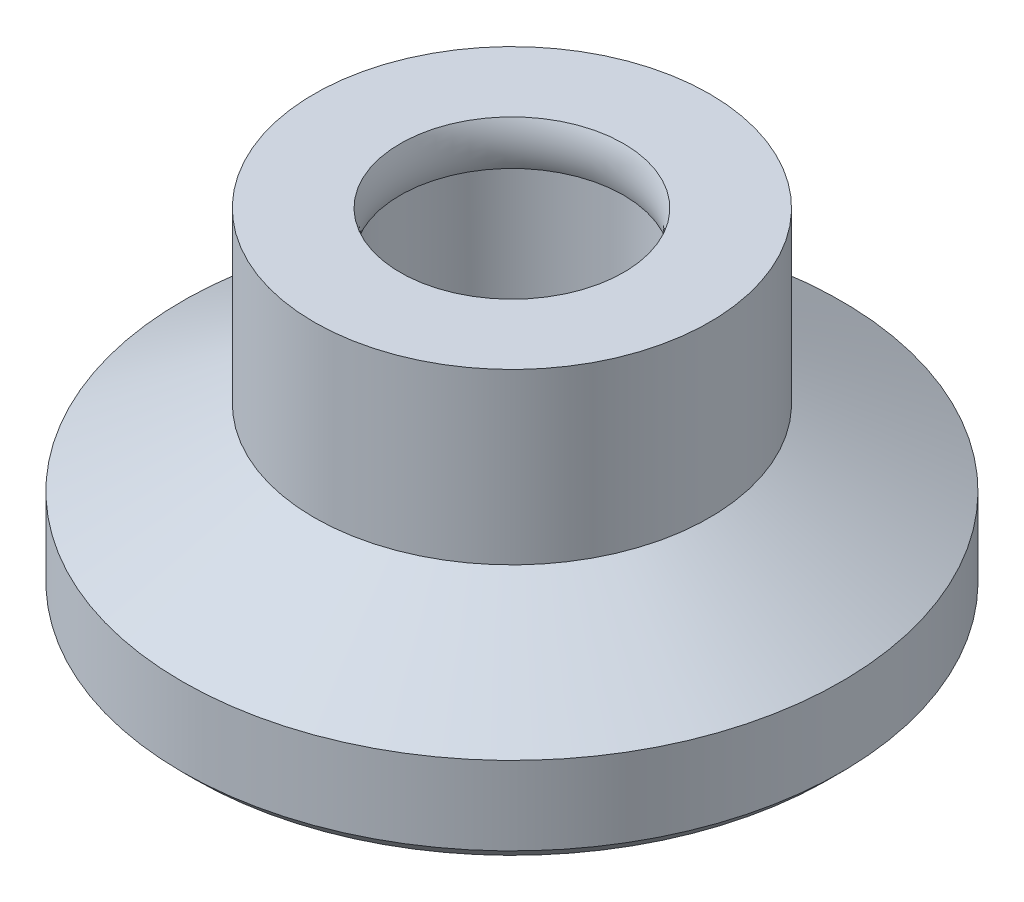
ISO-10303-21;
HEADER;
FILE_DESCRIPTION(('STEP AP214'),'2;1');
FILE_NAME('part.step','',(''),(''),'','','');
FILE_SCHEMA(('AUTOMOTIVE_DESIGN { 1 0 10303 214 1 1 1 1 }'));
ENDSEC;
DATA;
#1=APPLICATION_CONTEXT('core data for automotive mechanical design processes');
#2=APPLICATION_PROTOCOL_DEFINITION('international standard','automotive_design',2000,#1);
#3=PRODUCT_CONTEXT('',#1,'mechanical');
#4=PRODUCT('Part','Part','',(#3));
#5=PRODUCT_RELATED_PRODUCT_CATEGORY('part','',(#4));
#6=PRODUCT_DEFINITION_FORMATION('','',#4);
#7=PRODUCT_DEFINITION_CONTEXT('part definition',#1,'design');
#8=PRODUCT_DEFINITION('design','',#6,#7);
#9=PRODUCT_DEFINITION_SHAPE('','',#8);
#10=(LENGTH_UNIT() NAMED_UNIT(*) SI_UNIT(.MILLI.,.METRE.));
#11=(NAMED_UNIT(*) PLANE_ANGLE_UNIT() SI_UNIT($,.RADIAN.));
#12=(NAMED_UNIT(*) SI_UNIT($,.STERADIAN.) SOLID_ANGLE_UNIT());
#13=UNCERTAINTY_MEASURE_WITH_UNIT(LENGTH_MEASURE(1.E-05),#10,'distance_accuracy_value','');
#14=(GEOMETRIC_REPRESENTATION_CONTEXT(3) GLOBAL_UNCERTAINTY_ASSIGNED_CONTEXT((#13)) GLOBAL_UNIT_ASSIGNED_CONTEXT((#10,
#11,#12)) REPRESENTATION_CONTEXT('',''));
#15=CARTESIAN_POINT('',(0.,0.,0.));
#16=DIRECTION('',(0.,0.,1.));
#17=DIRECTION('',(1.,0.,0.));
#18=AXIS2_PLACEMENT_3D('',#15,#16,#17);
#19=CARTESIAN_POINT('',(0.,4.6,0.));
#20=DIRECTION('',(0.,-1.,0.));
#21=DIRECTION('',(0.,0.,-1.));
#22=AXIS2_PLACEMENT_3D('',#19,#20,#21);
#23=CYLINDRICAL_SURFACE('',#22,5.4);
#24=CARTESIAN_POINT('',(0.,-0.0215390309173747,0.));
#25=DIRECTION('',(0.,1.,0.));
#26=DIRECTION('',(0.,0.,1.));
#27=AXIS2_PLACEMENT_3D('',#24,#25,#26);
#28=CIRCLE('',#27,5.4);
#29=CARTESIAN_POINT('',(0.,-0.0215390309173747,5.4));
#30=VERTEX_POINT('',#29);
#31=EDGE_CURVE('E91',#30,#30,#28,.T.);
#32=ORIENTED_EDGE('',*,*,#31,.T.);
#33=EDGE_LOOP('',(#32));
#34=FACE_BOUND('',#33,.T.);
#35=CARTESIAN_POINT('',(0.,4.6,0.));
#36=DIRECTION('',(0.,1.,0.));
#37=DIRECTION('',(0.,0.,1.));
#38=AXIS2_PLACEMENT_3D('',#35,#36,#37);
#39=CIRCLE('',#38,5.4);
#40=CARTESIAN_POINT('',(0.,4.6,5.4));
#41=VERTEX_POINT('',#40);
#42=EDGE_CURVE('E93',#41,#41,#39,.T.);
#43=ORIENTED_EDGE('',*,*,#42,.F.);
#44=EDGE_LOOP('',(#43));
#45=FACE_BOUND('',#44,.T.);
#46=ADVANCED_FACE('F37',(#34,#45),#23,.T.);
#47=CARTESIAN_POINT('',(0.,4.6,0.));
#48=DIRECTION('',(0.,1.,0.));
#49=DIRECTION('',(0.,0.,1.));
#50=AXIS2_PLACEMENT_3D('',#47,#48,#49);
#51=PLANE('',#50);
#52=CARTESIAN_POINT('',(0.,4.6,0.));
#53=DIRECTION('',(0.,-1.,0.));
#54=DIRECTION('',(0.,0.,-1.));
#55=AXIS2_PLACEMENT_3D('',#52,#53,#54);
#56=CIRCLE('',#55,3.05);
#57=CARTESIAN_POINT('',(0.,4.6,-3.05));
#58=VERTEX_POINT('',#57);
#59=EDGE_CURVE('E113',#58,#58,#56,.T.);
#60=ORIENTED_EDGE('',*,*,#59,.T.);
#61=EDGE_LOOP('',(#60));
#62=FACE_BOUND('',#61,.T.);
#63=ORIENTED_EDGE('',*,*,#42,.T.);
#64=EDGE_LOOP('',(#63));
#65=FACE_BOUND('',#64,.T.);
#66=ADVANCED_FACE('F65',(#62,#65),#51,.T.);
#67=CARTESIAN_POINT('',(0.,-0.0215390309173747,0.));
#68=DIRECTION('',(0.,-1.,0.));
#69=DIRECTION('',(0.,0.,-1.));
#70=AXIS2_PLACEMENT_3D('',#67,#68,#69);
#71=CONICAL_SURFACE('',#70,5.4,1.0471975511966);
#72=CARTESIAN_POINT('',(0.,-2.1,0.));
#73=DIRECTION('',(0.,1.,0.));
#74=DIRECTION('',(0.,0.,1.));
#75=AXIS2_PLACEMENT_3D('',#72,#73,#74);
#76=CIRCLE('',#75,9.);
#77=CARTESIAN_POINT('',(0.,-2.1,9.));
#78=VERTEX_POINT('',#77);
#79=EDGE_CURVE('E89',#78,#78,#76,.T.);
#80=ORIENTED_EDGE('',*,*,#79,.T.);
#81=EDGE_LOOP('',(#80));
#82=FACE_BOUND('',#81,.T.);
#83=ORIENTED_EDGE('',*,*,#31,.F.);
#84=EDGE_LOOP('',(#83));
#85=FACE_BOUND('',#84,.T.);
#86=ADVANCED_FACE('F70',(#82,#85),#71,.T.);
#87=CARTESIAN_POINT('',(0.,-4.6,0.));
#88=DIRECTION('',(0.,1.,0.));
#89=DIRECTION('',(0.,0.,1.));
#90=AXIS2_PLACEMENT_3D('',#87,#88,#89);
#91=PLANE('',#90);
#92=CARTESIAN_POINT('',(0.,-4.6,0.));
#93=DIRECTION('',(0.,1.,0.));
#94=DIRECTION('',(0.,0.,1.));
#95=AXIS2_PLACEMENT_3D('',#92,#93,#94);
#96=CIRCLE('',#95,8.64);
#97=CARTESIAN_POINT('',(0.,-4.6,8.64));
#98=VERTEX_POINT('',#97);
#99=EDGE_CURVE('E45',#98,#98,#96,.F.);
#100=ORIENTED_EDGE('',*,*,#99,.T.);
#101=EDGE_LOOP('',(#100));
#102=FACE_BOUND('',#101,.T.);
#103=ADVANCED_FACE('F76',(#102),#91,.F.);
#104=CARTESIAN_POINT('',(0.,-2.1,0.));
#105=DIRECTION('',(0.,-1.,0.));
#106=DIRECTION('',(0.,0.,-1.));
#107=AXIS2_PLACEMENT_3D('',#104,#105,#106);
#108=CYLINDRICAL_SURFACE('',#107,9.);
#109=CARTESIAN_POINT('',(0.,-4.23999999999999,0.));
#110=DIRECTION('',(0.,1.,0.));
#111=DIRECTION('',(0.,0.,1.));
#112=AXIS2_PLACEMENT_3D('',#109,#110,#111);
#113=CIRCLE('',#112,9.);
#114=CARTESIAN_POINT('',(0.,-4.23999999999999,9.));
#115=VERTEX_POINT('',#114);
#116=EDGE_CURVE('E11',#115,#115,#113,.T.);
#117=ORIENTED_EDGE('',*,*,#116,.T.);
#118=EDGE_LOOP('',(#117));
#119=FACE_BOUND('',#118,.T.);
#120=ORIENTED_EDGE('',*,*,#79,.F.);
#121=EDGE_LOOP('',(#120));
#122=FACE_BOUND('',#121,.T.);
#123=ADVANCED_FACE('F60',(#119,#122),#108,.T.);
#124=CARTESIAN_POINT('',(0.,-4.6,0.));
#125=DIRECTION('',(0.,1.,0.));
#126=DIRECTION('',(0.,0.,1.));
#127=AXIS2_PLACEMENT_3D('',#124,#125,#126);
#128=CONICAL_SURFACE('',#127,8.64,0.785398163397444);
#129=ORIENTED_EDGE('',*,*,#116,.F.);
#130=EDGE_LOOP('',(#129));
#131=FACE_BOUND('',#130,.T.);
#132=ORIENTED_EDGE('',*,*,#99,.F.);
#133=EDGE_LOOP('',(#132));
#134=FACE_BOUND('',#133,.T.);
#135=ADVANCED_FACE('F39',(#131,#134),#128,.T.);
#136=CARTESIAN_POINT('',(0.,-2.1,0.));
#137=DIRECTION('',(0.,1.,0.));
#138=DIRECTION('',(0.,0.,1.));
#139=AXIS2_PLACEMENT_3D('',#136,#137,#138);
#140=CONICAL_SURFACE('',#139,0.,1.04719755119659);
#141=CARTESIAN_POINT('',(0.,-0.339081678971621,0.));
#142=DIRECTION('',(0.,-1.,0.));
#143=DIRECTION('',(0.,0.,-1.));
#144=AXIS2_PLACEMENT_3D('',#141,#142,#143);
#145=CIRCLE('',#144,3.05);
#146=CARTESIAN_POINT('',(0.,-0.339081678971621,-3.05));
#147=VERTEX_POINT('',#146);
#148=EDGE_CURVE('E100',#147,#147,#145,.T.);
#149=ORIENTED_EDGE('',*,*,#148,.F.);
#150=EDGE_LOOP('',(#149));
#151=FACE_BOUND('',#150,.T.);
#152=CARTESIAN_POINT('',(0.,-2.1,0.));
#153=VERTEX_POINT('',#152);
#154=VERTEX_LOOP('',#153);
#155=FACE_BOUND('',#154,.T.);
#156=ADVANCED_FACE('F48',(#151,#155),#140,.F.);
#157=CARTESIAN_POINT('',(0.,0.,0.));
#158=DIRECTION('',(0.,-1.,0.));
#159=DIRECTION('',(0.,0.,-1.));
#160=AXIS2_PLACEMENT_3D('',#157,#158,#159);
#161=CYLINDRICAL_SURFACE('',#160,3.05);
#162=CARTESIAN_POINT('',(0.,3.38,0.));
#163=DIRECTION('',(0.,-1.,0.));
#164=DIRECTION('',(0.,0.,-1.));
#165=AXIS2_PLACEMENT_3D('',#162,#163,#164);
#166=CIRCLE('',#165,3.05);
#167=CARTESIAN_POINT('',(0.,3.38,-3.05));
#168=VERTEX_POINT('',#167);
#169=EDGE_CURVE('E109',#168,#168,#166,.T.);
#170=ORIENTED_EDGE('',*,*,#169,.F.);
#171=EDGE_LOOP('',(#170));
#172=FACE_BOUND('',#171,.T.);
#173=ORIENTED_EDGE('',*,*,#148,.T.);
#174=EDGE_LOOP('',(#173));
#175=FACE_BOUND('',#174,.T.);
#176=ADVANCED_FACE('F50',(#172,#175),#161,.F.);
#177=CARTESIAN_POINT('',(0.,3.99,0.));
#178=DIRECTION('',(0.,-1.,0.));
#179=DIRECTION('',(0.,0.,-1.));
#180=AXIS2_PLACEMENT_3D('',#177,#178,#179);
#181=TOROIDAL_SURFACE('',#180,4.514,1.586);
#182=ORIENTED_EDGE('',*,*,#59,.F.);
#183=EDGE_LOOP('',(#182));
#184=FACE_BOUND('',#183,.T.);
#185=ORIENTED_EDGE('',*,*,#169,.T.);
#186=EDGE_LOOP('',(#185));
#187=FACE_BOUND('',#186,.T.);
#188=ADVANCED_FACE('F57',(#184,#187),#181,.T.);
#189=CLOSED_SHELL('',(#46,#66,#86,#103,#123,#135,#156,#176,#188));
#190=MANIFOLD_SOLID_BREP('B2',#189);
#191=ADVANCED_BREP_SHAPE_REPRESENTATION('',(#18,#190),#14);
#192=SHAPE_DEFINITION_REPRESENTATION(#9,#191);
ENDSEC;
END-ISO-10303-21;
